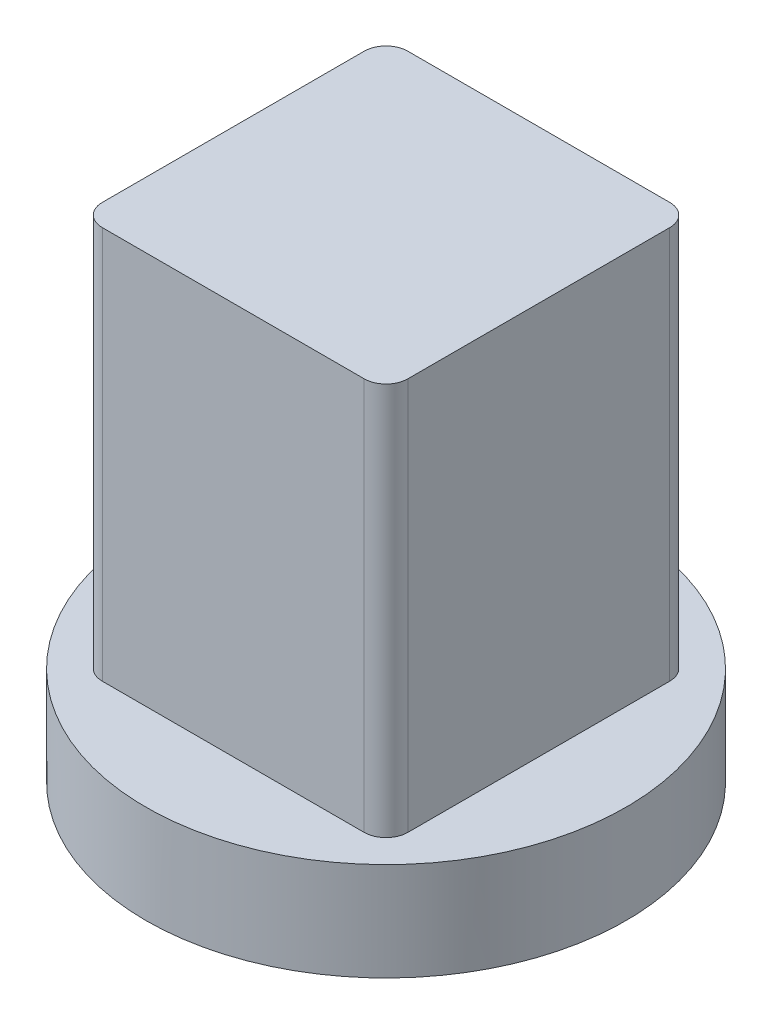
ISO-10303-21;
HEADER;
FILE_DESCRIPTION(('STEP AP214'),'2;1');
FILE_NAME('part.step','',(''),(''),'','','');
FILE_SCHEMA(('AUTOMOTIVE_DESIGN { 1 0 10303 214 1 1 1 1 }'));
ENDSEC;
DATA;
#1=APPLICATION_CONTEXT('core data for automotive mechanical design processes');
#2=APPLICATION_PROTOCOL_DEFINITION('international standard','automotive_design',2000,#1);
#3=PRODUCT_CONTEXT('',#1,'mechanical');
#4=PRODUCT('Part','Part','',(#3));
#5=PRODUCT_RELATED_PRODUCT_CATEGORY('part','',(#4));
#6=PRODUCT_DEFINITION_FORMATION('','',#4);
#7=PRODUCT_DEFINITION_CONTEXT('part definition',#1,'design');
#8=PRODUCT_DEFINITION('design','',#6,#7);
#9=PRODUCT_DEFINITION_SHAPE('','',#8);
#10=(LENGTH_UNIT() NAMED_UNIT(*) SI_UNIT(.MILLI.,.METRE.));
#11=(NAMED_UNIT(*) PLANE_ANGLE_UNIT() SI_UNIT($,.RADIAN.));
#12=(NAMED_UNIT(*) SI_UNIT($,.STERADIAN.) SOLID_ANGLE_UNIT());
#13=UNCERTAINTY_MEASURE_WITH_UNIT(LENGTH_MEASURE(1.E-05),#10,'distance_accuracy_value','');
#14=(GEOMETRIC_REPRESENTATION_CONTEXT(3) GLOBAL_UNCERTAINTY_ASSIGNED_CONTEXT((#13)) GLOBAL_UNIT_ASSIGNED_CONTEXT((#10,
#11,#12)) REPRESENTATION_CONTEXT('',''));
#15=CARTESIAN_POINT('',(0.,0.,0.));
#16=DIRECTION('',(0.,0.,1.));
#17=DIRECTION('',(1.,0.,0.));
#18=AXIS2_PLACEMENT_3D('',#15,#16,#17);
#19=CARTESIAN_POINT('',(7.,19.5,7.));
#20=DIRECTION('',(-1.,0.,0.));
#21=DIRECTION('',(0.,0.,1.));
#22=AXIS2_PLACEMENT_3D('',#19,#20,#21);
#23=PLANE('',#22);
#24=DIRECTION('',(0.,0.,1.));
#25=VECTOR('',#24,1.);
#26=CARTESIAN_POINT('',(7.,1.5,7.));
#27=LINE('',#26,#25);
#28=CARTESIAN_POINT('',(7.,1.5,-6.));
#29=VERTEX_POINT('',#28);
#30=CARTESIAN_POINT('',(7.,1.5,6.));
#31=VERTEX_POINT('',#30);
#32=EDGE_CURVE('E109',#29,#31,#27,.T.);
#33=ORIENTED_EDGE('',*,*,#32,.F.);
#34=DIRECTION('',(0.,-1.,0.));
#35=VECTOR('',#34,1.);
#36=CARTESIAN_POINT('',(7.,19.5,-6.));
#37=LINE('',#36,#35);
#38=CARTESIAN_POINT('',(7.,19.5,-6.));
#39=VERTEX_POINT('',#38);
#40=EDGE_CURVE('E123',#29,#39,#37,.F.);
#41=ORIENTED_EDGE('',*,*,#40,.T.);
#42=DIRECTION('',(0.,0.,-1.));
#43=VECTOR('',#42,1.);
#44=CARTESIAN_POINT('',(7.,19.5,7.));
#45=LINE('',#44,#43);
#46=CARTESIAN_POINT('',(7.,19.5,6.));
#47=VERTEX_POINT('',#46);
#48=EDGE_CURVE('E161',#47,#39,#45,.T.);
#49=ORIENTED_EDGE('',*,*,#48,.F.);
#50=DIRECTION('',(0.,-1.,0.));
#51=VECTOR('',#50,1.);
#52=CARTESIAN_POINT('',(7.,19.5,6.));
#53=LINE('',#52,#51);
#54=EDGE_CURVE('E115',#47,#31,#53,.T.);
#55=ORIENTED_EDGE('',*,*,#54,.T.);
#56=EDGE_LOOP('',(#33,#41,#49,#55));
#57=FACE_BOUND('',#56,.T.);
#58=ADVANCED_FACE('F35',(#57),#23,.F.);
#59=CARTESIAN_POINT('',(-7.,19.5,-7.));
#60=DIRECTION('',(0.,0.,1.));
#61=DIRECTION('',(1.,0.,0.));
#62=AXIS2_PLACEMENT_3D('',#59,#60,#61);
#63=PLANE('',#62);
#64=DIRECTION('',(-1.,0.,0.));
#65=VECTOR('',#64,1.);
#66=CARTESIAN_POINT('',(-7.,19.5,-7.));
#67=LINE('',#66,#65);
#68=CARTESIAN_POINT('',(6.,19.5,-7.));
#69=VERTEX_POINT('',#68);
#70=CARTESIAN_POINT('',(-6.,19.5,-7.));
#71=VERTEX_POINT('',#70);
#72=EDGE_CURVE('E165',#69,#71,#67,.T.);
#73=ORIENTED_EDGE('',*,*,#72,.F.);
#74=DIRECTION('',(0.,-1.,0.));
#75=VECTOR('',#74,1.);
#76=CARTESIAN_POINT('',(6.,19.5,-7.));
#77=LINE('',#76,#75);
#78=CARTESIAN_POINT('',(6.,1.5,-7.));
#79=VERTEX_POINT('',#78);
#80=EDGE_CURVE('E108',#69,#79,#77,.T.);
#81=ORIENTED_EDGE('',*,*,#80,.T.);
#82=DIRECTION('',(1.,0.,0.));
#83=VECTOR('',#82,1.);
#84=CARTESIAN_POINT('',(-7.,1.5,-7.));
#85=LINE('',#84,#83);
#86=CARTESIAN_POINT('',(-6.,1.5,-7.));
#87=VERTEX_POINT('',#86);
#88=EDGE_CURVE('E99',#87,#79,#85,.T.);
#89=ORIENTED_EDGE('',*,*,#88,.F.);
#90=DIRECTION('',(0.,-1.,0.));
#91=VECTOR('',#90,1.);
#92=CARTESIAN_POINT('',(-6.,19.5,-7.));
#93=LINE('',#92,#91);
#94=EDGE_CURVE('E105',#87,#71,#93,.F.);
#95=ORIENTED_EDGE('',*,*,#94,.T.);
#96=EDGE_LOOP('',(#73,#81,#89,#95));
#97=FACE_BOUND('',#96,.T.);
#98=ADVANCED_FACE('F104',(#97),#63,.F.);
#99=CARTESIAN_POINT('',(-7.,19.5,7.));
#100=DIRECTION('',(1.,0.,0.));
#101=DIRECTION('',(0.,0.,-1.));
#102=AXIS2_PLACEMENT_3D('',#99,#100,#101);
#103=PLANE('',#102);
#104=DIRECTION('',(0.,0.,-1.));
#105=VECTOR('',#104,1.);
#106=CARTESIAN_POINT('',(-7.,1.5,7.));
#107=LINE('',#106,#105);
#108=CARTESIAN_POINT('',(-7.,1.5,6.));
#109=VERTEX_POINT('',#108);
#110=CARTESIAN_POINT('',(-7.,1.5,-6.));
#111=VERTEX_POINT('',#110);
#112=EDGE_CURVE('E100',#109,#111,#107,.T.);
#113=ORIENTED_EDGE('',*,*,#112,.F.);
#114=DIRECTION('',(0.,-1.,0.));
#115=VECTOR('',#114,1.);
#116=CARTESIAN_POINT('',(-7.,19.5,6.));
#117=LINE('',#116,#115);
#118=CARTESIAN_POINT('',(-7.,19.5,6.));
#119=VERTEX_POINT('',#118);
#120=EDGE_CURVE('E139',#109,#119,#117,.F.);
#121=ORIENTED_EDGE('',*,*,#120,.T.);
#122=DIRECTION('',(0.,0.,1.));
#123=VECTOR('',#122,1.);
#124=CARTESIAN_POINT('',(-7.,19.5,7.));
#125=LINE('',#124,#123);
#126=CARTESIAN_POINT('',(-7.,19.5,-6.));
#127=VERTEX_POINT('',#126);
#128=EDGE_CURVE('E167',#127,#119,#125,.T.);
#129=ORIENTED_EDGE('',*,*,#128,.F.);
#130=DIRECTION('',(0.,-1.,0.));
#131=VECTOR('',#130,1.);
#132=CARTESIAN_POINT('',(-7.,19.5,-6.));
#133=LINE('',#132,#131);
#134=EDGE_CURVE('E137',#127,#111,#133,.T.);
#135=ORIENTED_EDGE('',*,*,#134,.T.);
#136=EDGE_LOOP('',(#113,#121,#129,#135));
#137=FACE_BOUND('',#136,.T.);
#138=ADVANCED_FACE('F178',(#137),#103,.F.);
#139=CARTESIAN_POINT('',(-7.,19.5,7.));
#140=DIRECTION('',(0.,0.,-1.));
#141=DIRECTION('',(-1.,0.,0.));
#142=AXIS2_PLACEMENT_3D('',#139,#140,#141);
#143=PLANE('',#142);
#144=DIRECTION('',(-1.,0.,0.));
#145=VECTOR('',#144,1.);
#146=CARTESIAN_POINT('',(-7.,1.5,7.));
#147=LINE('',#146,#145);
#148=CARTESIAN_POINT('',(6.,1.5,7.));
#149=VERTEX_POINT('',#148);
#150=CARTESIAN_POINT('',(-6.,1.5,7.));
#151=VERTEX_POINT('',#150);
#152=EDGE_CURVE('E113',#149,#151,#147,.T.);
#153=ORIENTED_EDGE('',*,*,#152,.F.);
#154=DIRECTION('',(0.,-1.,0.));
#155=VECTOR('',#154,1.);
#156=CARTESIAN_POINT('',(6.,19.5,7.));
#157=LINE('',#156,#155);
#158=CARTESIAN_POINT('',(6.,19.5,7.));
#159=VERTEX_POINT('',#158);
#160=EDGE_CURVE('E135',#149,#159,#157,.F.);
#161=ORIENTED_EDGE('',*,*,#160,.T.);
#162=DIRECTION('',(1.,0.,0.));
#163=VECTOR('',#162,1.);
#164=CARTESIAN_POINT('',(-7.,19.5,7.));
#165=LINE('',#164,#163);
#166=CARTESIAN_POINT('',(-6.,19.5,7.));
#167=VERTEX_POINT('',#166);
#168=EDGE_CURVE('E117',#167,#159,#165,.T.);
#169=ORIENTED_EDGE('',*,*,#168,.F.);
#170=DIRECTION('',(0.,-1.,0.));
#171=VECTOR('',#170,1.);
#172=CARTESIAN_POINT('',(-6.,19.5,7.));
#173=LINE('',#172,#171);
#174=EDGE_CURVE('E132',#167,#151,#173,.T.);
#175=ORIENTED_EDGE('',*,*,#174,.T.);
#176=EDGE_LOOP('',(#153,#161,#169,#175));
#177=FACE_BOUND('',#176,.T.);
#178=ADVANCED_FACE('F151',(#177),#143,.F.);
#179=CARTESIAN_POINT('',(0.,19.5,0.));
#180=DIRECTION('',(0.,-1.,0.));
#181=DIRECTION('',(0.,0.,-1.));
#182=AXIS2_PLACEMENT_3D('',#179,#180,#181);
#183=PLANE('',#182);
#184=ORIENTED_EDGE('',*,*,#48,.T.);
#185=CARTESIAN_POINT('',(6.,19.5,-6.));
#186=DIRECTION('',(0.,-1.,0.));
#187=DIRECTION('',(0.,0.,-1.));
#188=AXIS2_PLACEMENT_3D('',#185,#186,#187);
#189=CIRCLE('',#188,1.);
#190=EDGE_CURVE('E130',#39,#69,#189,.F.);
#191=ORIENTED_EDGE('',*,*,#190,.T.);
#192=ORIENTED_EDGE('',*,*,#72,.T.);
#193=CARTESIAN_POINT('',(-6.,19.5,-6.));
#194=DIRECTION('',(0.,-1.,0.));
#195=DIRECTION('',(0.,0.,-1.));
#196=AXIS2_PLACEMENT_3D('',#193,#194,#195);
#197=CIRCLE('',#196,1.);
#198=EDGE_CURVE('E112',#71,#127,#197,.F.);
#199=ORIENTED_EDGE('',*,*,#198,.T.);
#200=ORIENTED_EDGE('',*,*,#128,.T.);
#201=CARTESIAN_POINT('',(-6.,19.5,6.));
#202=DIRECTION('',(0.,-1.,0.));
#203=DIRECTION('',(0.,0.,-1.));
#204=AXIS2_PLACEMENT_3D('',#201,#202,#203);
#205=CIRCLE('',#204,1.);
#206=EDGE_CURVE('E126',#119,#167,#205,.F.);
#207=ORIENTED_EDGE('',*,*,#206,.T.);
#208=ORIENTED_EDGE('',*,*,#168,.T.);
#209=CARTESIAN_POINT('',(6.,19.5,6.));
#210=DIRECTION('',(0.,-1.,0.));
#211=DIRECTION('',(0.,0.,-1.));
#212=AXIS2_PLACEMENT_3D('',#209,#210,#211);
#213=CIRCLE('',#212,1.);
#214=EDGE_CURVE('E128',#159,#47,#213,.F.);
#215=ORIENTED_EDGE('',*,*,#214,.T.);
#216=EDGE_LOOP('',(#184,#191,#192,#199,#200,#207,#208,#215));
#217=FACE_BOUND('',#216,.T.);
#218=ADVANCED_FACE('F160',(#217),#183,.F.);
#219=CARTESIAN_POINT('',(0.,1.5,0.));
#220=DIRECTION('',(0.,-1.,0.));
#221=DIRECTION('',(0.,0.,-1.));
#222=AXIS2_PLACEMENT_3D('',#219,#220,#221);
#223=PLANE('',#222);
#224=CARTESIAN_POINT('',(0.,1.5,0.));
#225=DIRECTION('',(0.,-1.,0.));
#226=DIRECTION('',(0.,0.,-1.));
#227=AXIS2_PLACEMENT_3D('',#224,#225,#226);
#228=CIRCLE('',#227,11.);
#229=CARTESIAN_POINT('',(0.,1.5,-11.));
#230=VERTEX_POINT('',#229);
#231=EDGE_CURVE('E179',#230,#230,#228,.T.);
#232=ORIENTED_EDGE('',*,*,#231,.F.);
#233=EDGE_LOOP('',(#232));
#234=FACE_BOUND('',#233,.T.);
#235=ORIENTED_EDGE('',*,*,#112,.T.);
#236=CARTESIAN_POINT('',(-6.,1.5,-6.));
#237=DIRECTION('',(0.,-1.,0.));
#238=DIRECTION('',(0.,0.,-1.));
#239=AXIS2_PLACEMENT_3D('',#236,#237,#238);
#240=CIRCLE('',#239,1.);
#241=EDGE_CURVE('E11',#111,#87,#240,.T.);
#242=ORIENTED_EDGE('',*,*,#241,.T.);
#243=ORIENTED_EDGE('',*,*,#88,.T.);
#244=CARTESIAN_POINT('',(6.,1.5,-6.));
#245=DIRECTION('',(0.,-1.,0.));
#246=DIRECTION('',(0.,0.,-1.));
#247=AXIS2_PLACEMENT_3D('',#244,#245,#246);
#248=CIRCLE('',#247,1.);
#249=EDGE_CURVE('E141',#79,#29,#248,.T.);
#250=ORIENTED_EDGE('',*,*,#249,.T.);
#251=ORIENTED_EDGE('',*,*,#32,.T.);
#252=CARTESIAN_POINT('',(6.,1.5,6.));
#253=DIRECTION('',(0.,-1.,0.));
#254=DIRECTION('',(0.,0.,-1.));
#255=AXIS2_PLACEMENT_3D('',#252,#253,#254);
#256=CIRCLE('',#255,1.);
#257=EDGE_CURVE('E143',#31,#149,#256,.T.);
#258=ORIENTED_EDGE('',*,*,#257,.T.);
#259=ORIENTED_EDGE('',*,*,#152,.T.);
#260=CARTESIAN_POINT('',(-6.,1.5,6.));
#261=DIRECTION('',(0.,-1.,0.));
#262=DIRECTION('',(0.,0.,-1.));
#263=AXIS2_PLACEMENT_3D('',#260,#261,#262);
#264=CIRCLE('',#263,1.);
#265=EDGE_CURVE('E43',#151,#109,#264,.T.);
#266=ORIENTED_EDGE('',*,*,#265,.T.);
#267=EDGE_LOOP('',(#235,#242,#243,#250,#251,#258,#259,#266));
#268=FACE_BOUND('',#267,.T.);
#269=ADVANCED_FACE('F98',(#234,#268),#223,.F.);
#270=CARTESIAN_POINT('',(0.,1.5,0.));
#271=DIRECTION('',(0.,-1.,0.));
#272=DIRECTION('',(0.,0.,-1.));
#273=AXIS2_PLACEMENT_3D('',#270,#271,#272);
#274=CYLINDRICAL_SURFACE('',#273,11.);
#275=ORIENTED_EDGE('',*,*,#231,.T.);
#276=EDGE_LOOP('',(#275));
#277=FACE_BOUND('',#276,.T.);
#278=CARTESIAN_POINT('',(0.,-3.,0.));
#279=DIRECTION('',(0.,1.,0.));
#280=DIRECTION('',(0.,0.,1.));
#281=AXIS2_PLACEMENT_3D('',#278,#279,#280);
#282=CIRCLE('',#281,11.);
#283=CARTESIAN_POINT('',(0.,-3.,11.));
#284=VERTEX_POINT('',#283);
#285=EDGE_CURVE('E182',#284,#284,#282,.T.);
#286=ORIENTED_EDGE('',*,*,#285,.T.);
#287=EDGE_LOOP('',(#286));
#288=FACE_BOUND('',#287,.T.);
#289=ADVANCED_FACE('F188',(#277,#288),#274,.T.);
#290=CARTESIAN_POINT('',(0.,-3.,0.));
#291=DIRECTION('',(0.,1.,0.));
#292=DIRECTION('',(0.,0.,1.));
#293=AXIS2_PLACEMENT_3D('',#290,#291,#292);
#294=PLANE('',#293);
#295=ORIENTED_EDGE('',*,*,#285,.F.);
#296=EDGE_LOOP('',(#295));
#297=FACE_BOUND('',#296,.T.);
#298=ADVANCED_FACE('F190',(#297),#294,.F.);
#299=CARTESIAN_POINT('',(6.,19.5,-6.));
#300=DIRECTION('',(0.,-1.,0.));
#301=DIRECTION('',(0.,0.,-1.));
#302=AXIS2_PLACEMENT_3D('',#299,#300,#301);
#303=CYLINDRICAL_SURFACE('',#302,1.);
#304=ORIENTED_EDGE('',*,*,#190,.F.);
#305=ORIENTED_EDGE('',*,*,#40,.F.);
#306=ORIENTED_EDGE('',*,*,#249,.F.);
#307=ORIENTED_EDGE('',*,*,#80,.F.);
#308=EDGE_LOOP('',(#304,#305,#306,#307));
#309=FACE_BOUND('',#308,.T.);
#310=ADVANCED_FACE('F192',(#309),#303,.T.);
#311=CARTESIAN_POINT('',(6.,19.5,6.));
#312=DIRECTION('',(0.,-1.,0.));
#313=DIRECTION('',(0.,0.,-1.));
#314=AXIS2_PLACEMENT_3D('',#311,#312,#313);
#315=CYLINDRICAL_SURFACE('',#314,1.);
#316=ORIENTED_EDGE('',*,*,#214,.F.);
#317=ORIENTED_EDGE('',*,*,#160,.F.);
#318=ORIENTED_EDGE('',*,*,#257,.F.);
#319=ORIENTED_EDGE('',*,*,#54,.F.);
#320=EDGE_LOOP('',(#316,#317,#318,#319));
#321=FACE_BOUND('',#320,.T.);
#322=ADVANCED_FACE('F156',(#321),#315,.T.);
#323=CARTESIAN_POINT('',(-6.,19.5,6.));
#324=DIRECTION('',(0.,-1.,0.));
#325=DIRECTION('',(0.,0.,-1.));
#326=AXIS2_PLACEMENT_3D('',#323,#324,#325);
#327=CYLINDRICAL_SURFACE('',#326,1.);
#328=ORIENTED_EDGE('',*,*,#206,.F.);
#329=ORIENTED_EDGE('',*,*,#120,.F.);
#330=ORIENTED_EDGE('',*,*,#265,.F.);
#331=ORIENTED_EDGE('',*,*,#174,.F.);
#332=EDGE_LOOP('',(#328,#329,#330,#331));
#333=FACE_BOUND('',#332,.T.);
#334=ADVANCED_FACE('F177',(#333),#327,.T.);
#335=CARTESIAN_POINT('',(-6.,19.5,-6.));
#336=DIRECTION('',(0.,-1.,0.));
#337=DIRECTION('',(0.,0.,-1.));
#338=AXIS2_PLACEMENT_3D('',#335,#336,#337);
#339=CYLINDRICAL_SURFACE('',#338,1.);
#340=ORIENTED_EDGE('',*,*,#198,.F.);
#341=ORIENTED_EDGE('',*,*,#94,.F.);
#342=ORIENTED_EDGE('',*,*,#241,.F.);
#343=ORIENTED_EDGE('',*,*,#134,.F.);
#344=EDGE_LOOP('',(#340,#341,#342,#343));
#345=FACE_BOUND('',#344,.T.);
#346=ADVANCED_FACE('F37',(#345),#339,.T.);
#347=CLOSED_SHELL('',(#58,#98,#138,#178,#218,#269,#289,#298,#310,#322,#334,#346));
#348=MANIFOLD_SOLID_BREP('B2',#347);
#349=ADVANCED_BREP_SHAPE_REPRESENTATION('',(#18,#348),#14);
#350=SHAPE_DEFINITION_REPRESENTATION(#9,#349);
ENDSEC;
END-ISO-10303-21;
